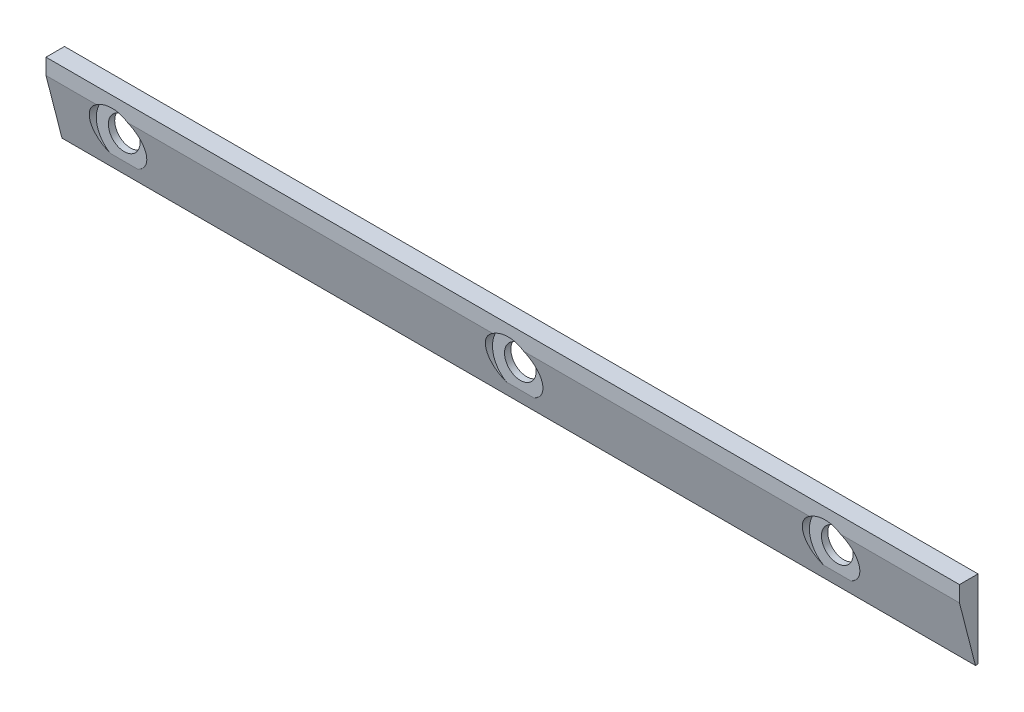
from build123d import *

# Parameters (mm, degrees)
BOSS_EXTRUDE1_DEPTH = 45.7581
SKETCH2_R           = 1.5875
CUT_EXTRUDE1_DEPTH  = 47.459059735
CUT_EXTRUDE2_START  = -0.635
SKETCH3_R           = 2.794
CUT_EXTRUDE2_DEPTH  = 46.824059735


with BuildPart() as part:
    # Sketch1 → Boss-Extrude1 (new, symmetric)
    with BuildSketch(Plane(origin=(0, 0, 0), x_dir=(0, 0, -1), z_dir=(1, 0, 0))):
        Polygon((0, 0), (0, -7.8232), (-0.254, -7.8232), (-1.8542, -1.5875), (-1.8542, 0), align=None)
    extrude(amount=BOSS_EXTRUDE1_DEPTH, both=True)

    # Sketch2 → Cut-Extrude1 (cut, through all)
    with BuildSketch(Plane(origin=(0, 0, 0), x_dir=(-1, 0, 0), z_dir=(0, 0, -1))):
        with Locations(Location((-32.2961, -3.9116, 0), (0, 0, 90))):
            Circle(SKETCH2_R)
        with Locations(Location((-0.5461, -3.9116, 0), (0, 0, 90))):
            Circle(SKETCH2_R)
        with Locations(Location((39.1414, -3.9116, 0), (0, 0, 90))):
            Circle(SKETCH2_R)
    extrude(amount=-CUT_EXTRUDE1_DEPTH, mode=Mode.SUBTRACT)

    # Sketch3 → Cut-Extrude2 (cut, through all)
    with BuildSketch(Plane(origin=(0, 0, 0), x_dir=(-1, 0, 0), z_dir=(0, 0, -1)).offset(CUT_EXTRUDE2_START)):
        with Locations((-32.2961, -3.9116)):
            Circle(SKETCH3_R)
        with Locations((-0.5461, -3.9116)):
            Circle(SKETCH3_R)
        with Locations((39.1414, -3.9116)):
            Circle(SKETCH3_R)
    extrude(amount=-CUT_EXTRUDE2_DEPTH, mode=Mode.SUBTRACT)


solid = part.part
